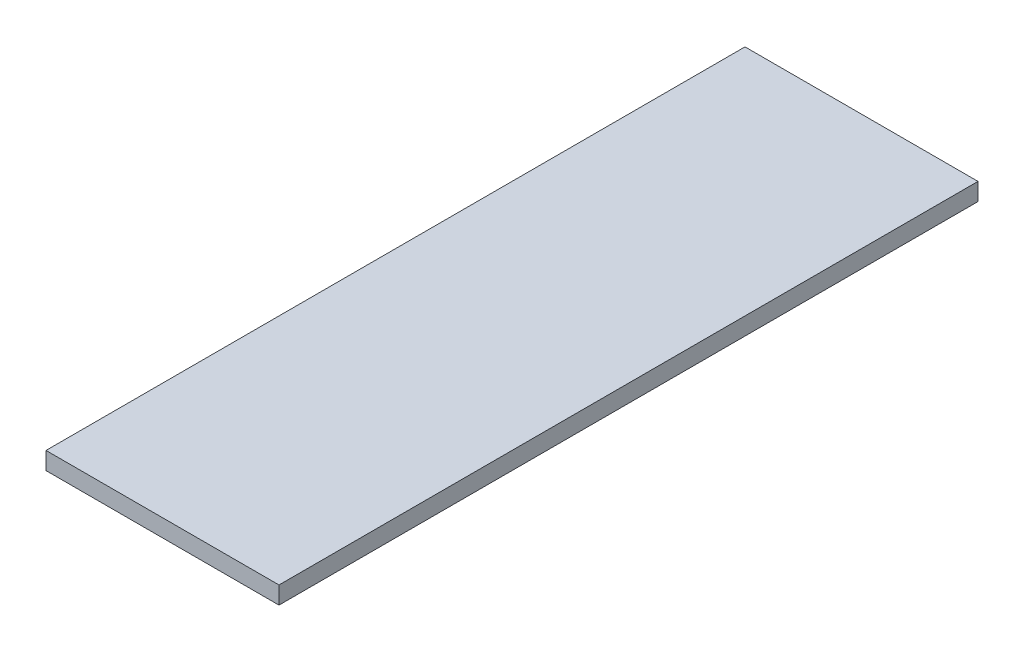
from build123d import *

# Parameters (mm, degrees)
BOSS_EXTRU_1_DEPTH      = 10
BOSS_EXTRU_1_DEPTH_BACK = 110
ESQUISSE1_W             = 40
ESQUISSE1_H             = 3


with BuildPart() as part:
    # Esquisse1 → Boss.-Extru.1 (new, two sides: drawn at the far end of the back side and taken through both)
    with BuildSketch(Plane.XY.offset(-BOSS_EXTRU_1_DEPTH_BACK)):
        with Locations((0, 93.5)):
            Rectangle(ESQUISSE1_W, ESQUISSE1_H)
    extrude(amount=BOSS_EXTRU_1_DEPTH + BOSS_EXTRU_1_DEPTH_BACK)


solid = part.part
